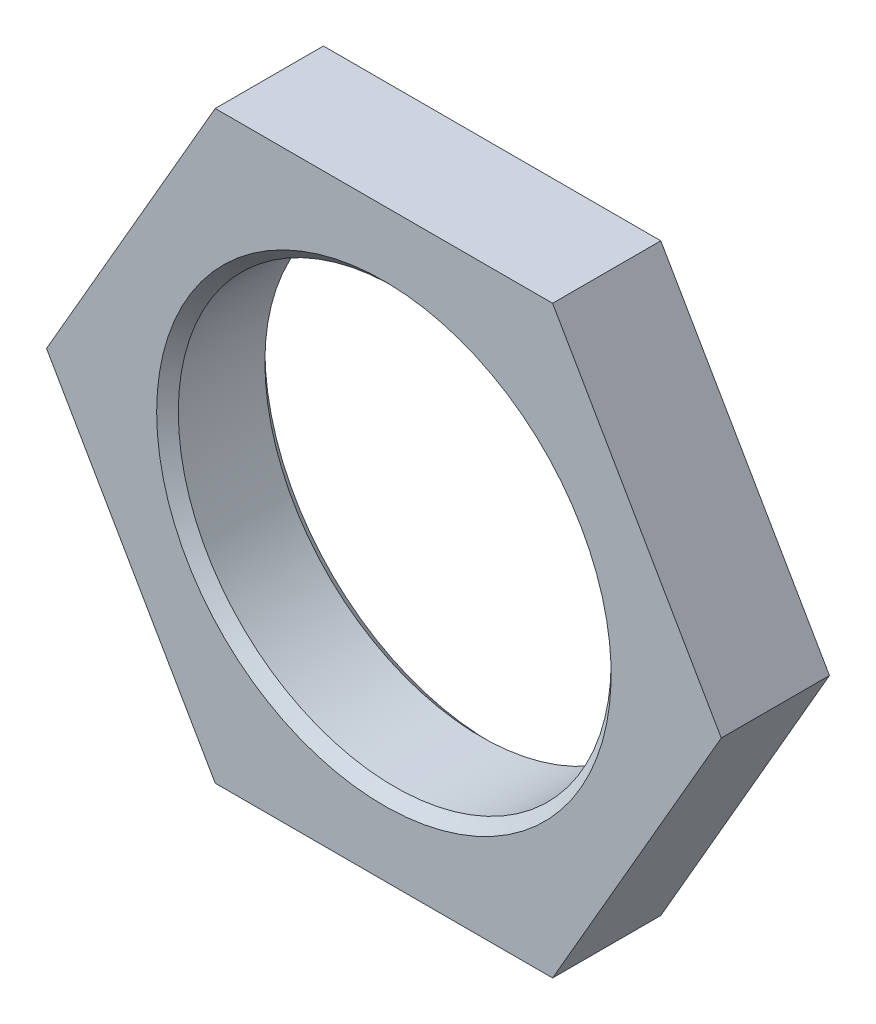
from build123d import *

# Parameters (mm, degrees)
BASE_EXTRUSION_DEPTH    = 1
ESQUISSE2_R             = 2
ENL_V_MAT_EXTRU_1_DEPTH = 5.243819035
CHANFREIN1_SIZE         = 0.1


with BuildPart() as part:
    # Esquisse1 → Base-Extrusion (new body)
    with BuildSketch(Plane.XY):
        Polygon((-1.558845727, 2.7), (1.558845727, 2.7), (3.117691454, 0), (1.558845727, -2.7), (-1.558845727, -2.7), (-3.117691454, 0), align=None)
    extrude(amount=BASE_EXTRUSION_DEPTH)

    # Esquisse2 → Enl_v. mat.-Extru.1 (cut, through all)
    with BuildSketch(Plane.XY.offset(1)):
        Circle(ESQUISSE2_R)
    extrude(amount=-ENL_V_MAT_EXTRU_1_DEPTH, mode=Mode.SUBTRACT)

    # Chanfrein1
    chanfrein1_edges = [part.edges().sort_by_distance(p)[0] for p in [
        (-2, 0, 0),
        (-2, 0, 1),
    ]]
    chamfer(chanfrein1_edges, length=CHANFREIN1_SIZE)


solid = part.part
